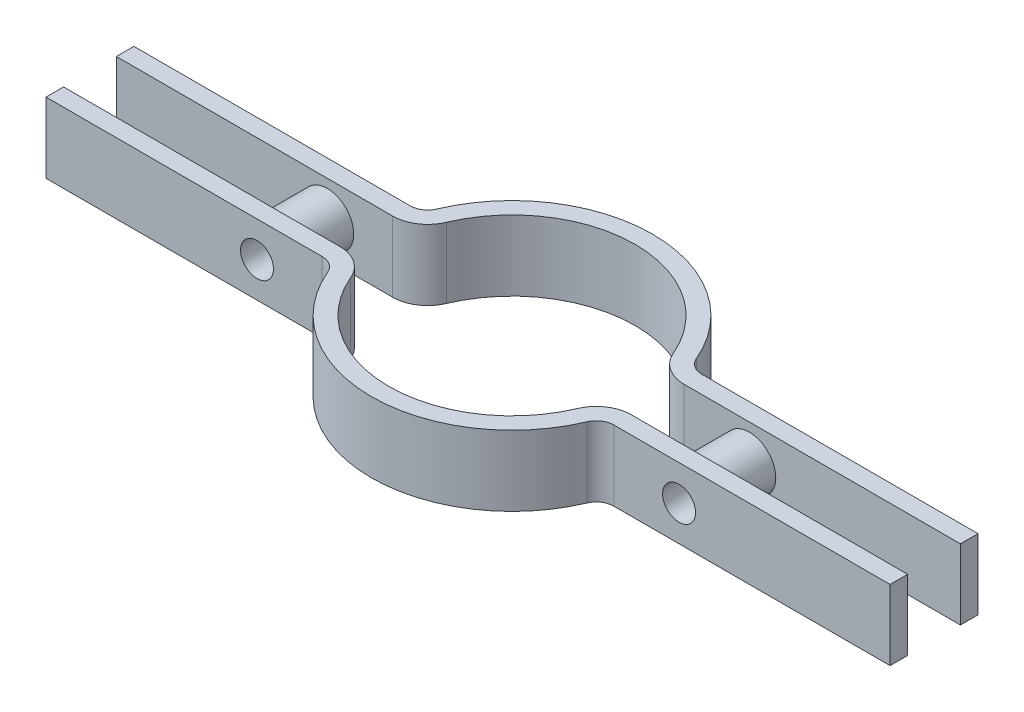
from build123d import *

# Parameters (mm, degrees)
EXTRUDE_THIN1_DEPTH      = 25.4
SKETCH3_R                = 9.525
EXTRUDE1_DEPTH           = 31.75
F_7_16_CLEARANCE_HOLE1_D = 11.90498


with BuildPart() as part:
    # Sketch2 → Extrude-Thin1 (new body)
    with BuildSketch(Plane(origin=(0, 0, 0), x_dir=(1, 0, 0), z_dir=(0, 1, 0))):
        with BuildLine():
            Line((-152.4, 9.525), (-52.651418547, 9.525))
            ThreePointArc((-52.651418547, 9.525), (-45.631229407, 11.641666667), (-40.951103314, 17.286111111))
            ThreePointArc((-40.951103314, 17.286111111), (0, 44.45), (40.951103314, 17.286111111))
            ThreePointArc((40.951103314, 17.286111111), (45.631229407, 11.641666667), (52.651418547, 9.525))
            Line((52.651418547, 9.525), (152.4, 9.525))
            Line((152.4, 9.525), (152.4, 15.875))
            Line((152.4, 15.875), (52.651418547, 15.875))
            ThreePointArc((52.651418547, 15.875), (49.141323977, 16.933333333), (46.801260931, 19.755555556))
            ThreePointArc((46.801260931, 19.755555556), (0, 50.8), (-46.801260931, 19.755555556))
            ThreePointArc((-46.801260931, 19.755555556), (-49.141323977, 16.933333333), (-52.651418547, 15.875))
            Line((-52.651418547, 15.875), (-152.4, 15.875))
            Line((-152.4, 15.875), (-152.4, 9.525))
        make_face()
    extrude(amount=EXTRUDE_THIN1_DEPTH)


with BuildPart() as body_2:
    # Mirror2: mirrored copy
    add(part.part.mirror(Plane.XY))


with BuildPart() as part_1:
    add(part.part)

    add(body_2.part)  # Extrude1 merges body 2
    # Sketch3 → Extrude1 (add)
    with BuildSketch(Plane.XY.offset(15.875)):
        with Locations((-76.2, 12.7)):
            Circle(SKETCH3_R)
    extrude1 = extrude(amount=-EXTRUDE1_DEPTH)

    # Mirror3: Extrude1 across plane
    add(extrude1.mirror(Plane(origin=(0, 0, 0), x_dir=(0, 0, 1), z_dir=(1, 0, 0))))

    # 7_16 Clearance Hole1 (through all)
    with Locations(Plane.XY.offset(15.875)):
        with Locations((-76.2, 12.7), (76.2, 12.7)):
            Hole(F_7_16_CLEARANCE_HOLE1_D / 2)


solid = part_1.part
